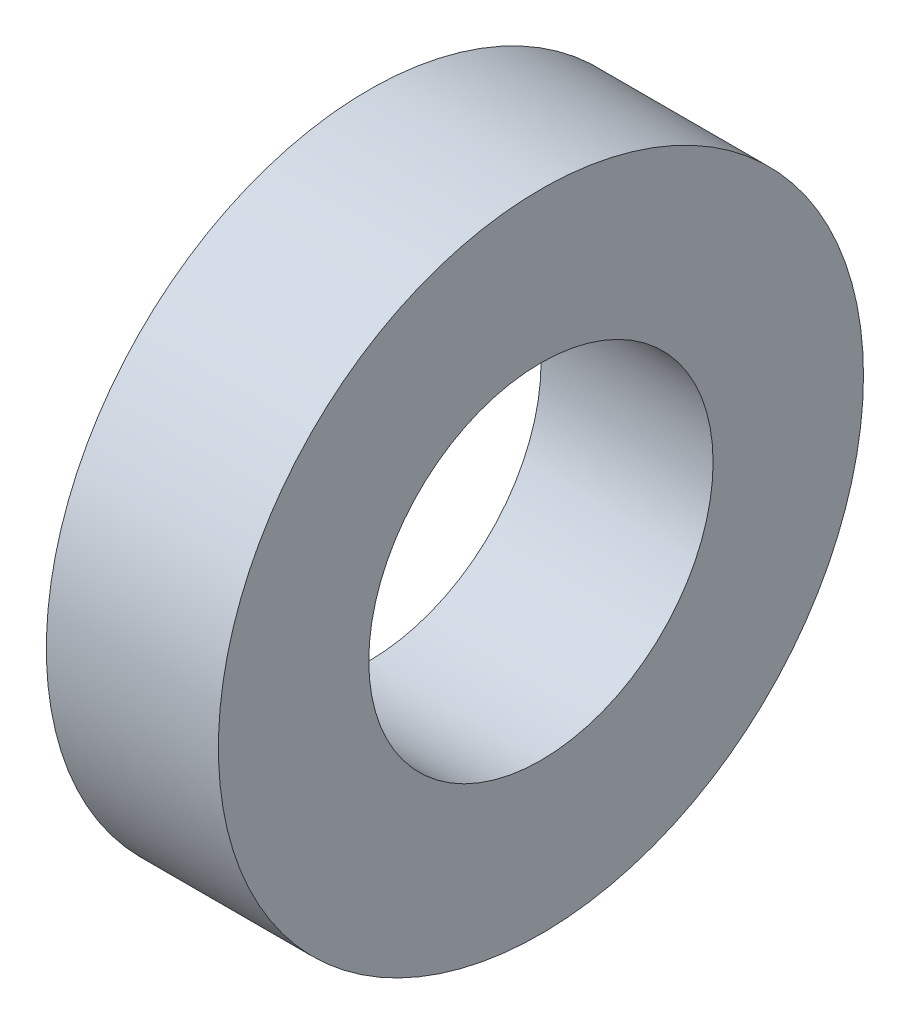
ISO-10303-21;
HEADER;
FILE_DESCRIPTION(('STEP AP214'),'2;1');
FILE_NAME('part.step','',(''),(''),'','','');
FILE_SCHEMA(('AUTOMOTIVE_DESIGN { 1 0 10303 214 1 1 1 1 }'));
ENDSEC;
DATA;
#1=APPLICATION_CONTEXT('core data for automotive mechanical design processes');
#2=APPLICATION_PROTOCOL_DEFINITION('international standard','automotive_design',2000,#1);
#3=PRODUCT_CONTEXT('',#1,'mechanical');
#4=PRODUCT('Part','Part','',(#3));
#5=PRODUCT_RELATED_PRODUCT_CATEGORY('part','',(#4));
#6=PRODUCT_DEFINITION_FORMATION('','',#4);
#7=PRODUCT_DEFINITION_CONTEXT('part definition',#1,'design');
#8=PRODUCT_DEFINITION('design','',#6,#7);
#9=PRODUCT_DEFINITION_SHAPE('','',#8);
#10=(LENGTH_UNIT() NAMED_UNIT(*) SI_UNIT(.MILLI.,.METRE.));
#11=(NAMED_UNIT(*) PLANE_ANGLE_UNIT() SI_UNIT($,.RADIAN.));
#12=(NAMED_UNIT(*) SI_UNIT($,.STERADIAN.) SOLID_ANGLE_UNIT());
#13=UNCERTAINTY_MEASURE_WITH_UNIT(LENGTH_MEASURE(1.E-05),#10,'distance_accuracy_value','');
#14=(GEOMETRIC_REPRESENTATION_CONTEXT(3) GLOBAL_UNCERTAINTY_ASSIGNED_CONTEXT((#13)) GLOBAL_UNIT_ASSIGNED_CONTEXT((#10,
#11,#12)) REPRESENTATION_CONTEXT('',''));
#15=CARTESIAN_POINT('',(0.,0.,0.));
#16=DIRECTION('',(0.,0.,1.));
#17=DIRECTION('',(1.,0.,0.));
#18=AXIS2_PLACEMENT_3D('',#15,#16,#17);
#19=CARTESIAN_POINT('',(4.,0.,0.));
#20=DIRECTION('',(1.,0.,0.));
#21=DIRECTION('',(0.,0.,-1.));
#22=AXIS2_PLACEMENT_3D('',#19,#20,#21);
#23=PLANE('',#22);
#24=CARTESIAN_POINT('',(4.,0.,0.));
#25=DIRECTION('',(1.,0.,0.));
#26=DIRECTION('',(0.,0.,-1.));
#27=AXIS2_PLACEMENT_3D('',#24,#25,#26);
#28=CIRCLE('',#27,7.49955854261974);
#29=CARTESIAN_POINT('',(4.,0.,-7.49955854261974));
#30=VERTEX_POINT('',#29);
#31=EDGE_CURVE('E10',#30,#30,#28,.T.);
#32=ORIENTED_EDGE('',*,*,#31,.T.);
#33=EDGE_LOOP('',(#32));
#34=FACE_BOUND('',#33,.T.);
#35=CARTESIAN_POINT('',(4.,0.,0.));
#36=DIRECTION('',(1.,0.,0.));
#37=DIRECTION('',(0.,0.,-1.));
#38=AXIS2_PLACEMENT_3D('',#35,#36,#37);
#39=CIRCLE('',#38,4.00289714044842);
#40=CARTESIAN_POINT('',(4.,0.,-4.00289714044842));
#41=VERTEX_POINT('',#40);
#42=EDGE_CURVE('E43',#41,#41,#39,.T.);
#43=ORIENTED_EDGE('',*,*,#42,.F.);
#44=EDGE_LOOP('',(#43));
#45=FACE_BOUND('',#44,.T.);
#46=ADVANCED_FACE('F32',(#34,#45),#23,.T.);
#47=CARTESIAN_POINT('',(0.,0.,0.));
#48=DIRECTION('',(1.,0.,0.));
#49=DIRECTION('',(0.,0.,-1.));
#50=AXIS2_PLACEMENT_3D('',#47,#48,#49);
#51=PLANE('',#50);
#52=CARTESIAN_POINT('',(0.,0.,0.));
#53=DIRECTION('',(1.,0.,0.));
#54=DIRECTION('',(0.,0.,-1.));
#55=AXIS2_PLACEMENT_3D('',#52,#53,#54);
#56=CIRCLE('',#55,7.49955854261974);
#57=CARTESIAN_POINT('',(0.,0.,-7.49955854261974));
#58=VERTEX_POINT('',#57);
#59=EDGE_CURVE('E36',#58,#58,#56,.T.);
#60=ORIENTED_EDGE('',*,*,#59,.F.);
#61=EDGE_LOOP('',(#60));
#62=FACE_BOUND('',#61,.T.);
#63=CARTESIAN_POINT('',(0.,0.,0.));
#64=DIRECTION('',(1.,0.,0.));
#65=DIRECTION('',(0.,0.,-1.));
#66=AXIS2_PLACEMENT_3D('',#63,#64,#65);
#67=CIRCLE('',#66,4.00289714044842);
#68=CARTESIAN_POINT('',(0.,0.,-4.00289714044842));
#69=VERTEX_POINT('',#68);
#70=EDGE_CURVE('E45',#69,#69,#67,.T.);
#71=ORIENTED_EDGE('',*,*,#70,.T.);
#72=EDGE_LOOP('',(#71));
#73=FACE_BOUND('',#72,.T.);
#74=ADVANCED_FACE('F55',(#62,#73),#51,.F.);
#75=CARTESIAN_POINT('',(4.,0.,0.));
#76=DIRECTION('',(-1.,0.,0.));
#77=DIRECTION('',(0.,0.,1.));
#78=AXIS2_PLACEMENT_3D('',#75,#76,#77);
#79=CYLINDRICAL_SURFACE('',#78,7.49955854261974);
#80=ORIENTED_EDGE('',*,*,#31,.F.);
#81=EDGE_LOOP('',(#80));
#82=FACE_BOUND('',#81,.T.);
#83=ORIENTED_EDGE('',*,*,#59,.T.);
#84=EDGE_LOOP('',(#83));
#85=FACE_BOUND('',#84,.T.);
#86=ADVANCED_FACE('F34',(#82,#85),#79,.T.);
#87=CARTESIAN_POINT('',(4.,0.,0.));
#88=DIRECTION('',(-1.,0.,0.));
#89=DIRECTION('',(0.,0.,1.));
#90=AXIS2_PLACEMENT_3D('',#87,#88,#89);
#91=CYLINDRICAL_SURFACE('',#90,4.00289714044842);
#92=ORIENTED_EDGE('',*,*,#42,.T.);
#93=EDGE_LOOP('',(#92));
#94=FACE_BOUND('',#93,.T.);
#95=ORIENTED_EDGE('',*,*,#70,.F.);
#96=EDGE_LOOP('',(#95));
#97=FACE_BOUND('',#96,.T.);
#98=ADVANCED_FACE('F51',(#94,#97),#91,.F.);
#99=CLOSED_SHELL('',(#46,#74,#86,#98));
#100=MANIFOLD_SOLID_BREP('B2',#99);
#101=ADVANCED_BREP_SHAPE_REPRESENTATION('',(#18,#100),#14);
#102=SHAPE_DEFINITION_REPRESENTATION(#9,#101);
ENDSEC;
END-ISO-10303-21;
